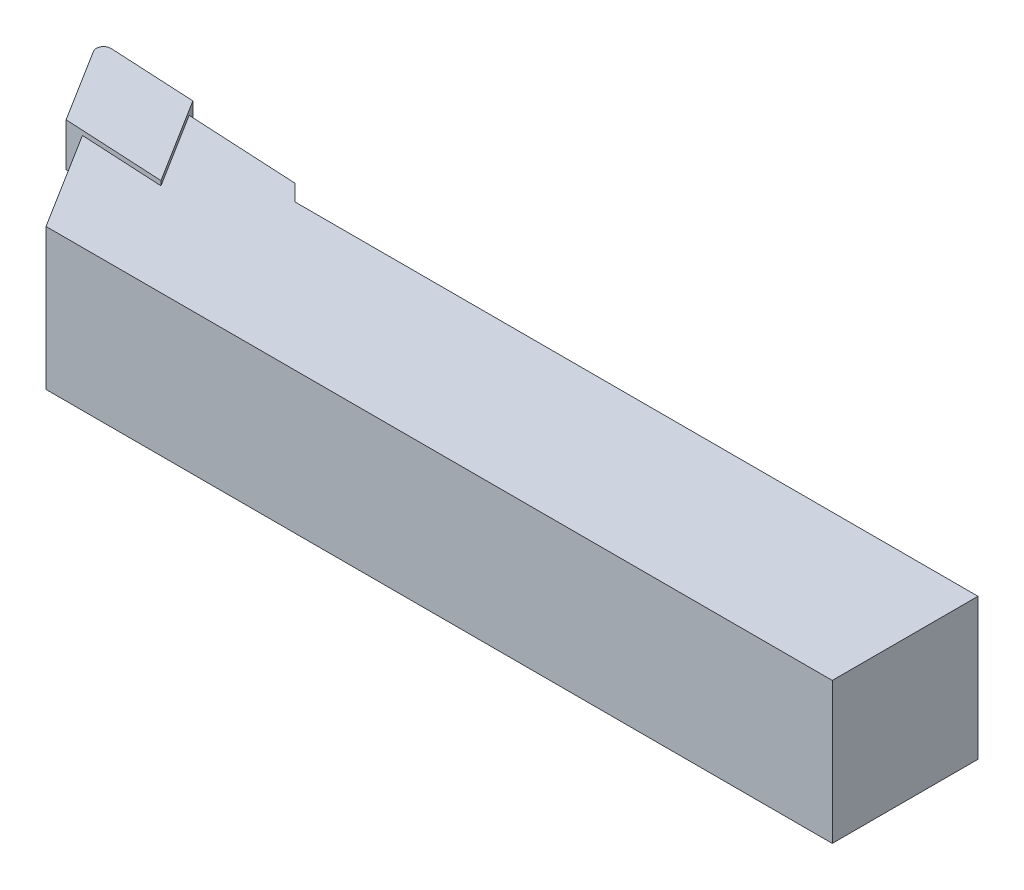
from build123d import *

# Parameters (mm, degrees)
BASE_EXTRUSION_DEPTH = 4.76
BOSS_EXTRU_1_DEPTH   = 15.5


with BuildPart() as part:
    # EsqPlaquette → Base-Extrusion (new body)
    with BuildSketch(Plane(origin=(0, 0, 0), x_dir=(1, 0, 0), z_dir=(0, 1, 0))):
        with BuildLine():
            Line((0.121561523, -1.223935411), (5.136301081, -9.249196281))
            Line((5.136301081, -9.249196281), (16.121225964, -9.824891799))
            Line((16.121225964, -9.824891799), (10.292114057, -0.496362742))
            Line((10.292114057, -0.496362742), (0.841868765, -0.001096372))
            ThreePointArc((0.841868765, -0.001096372), (0.110696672, -0.39396931), (0.121561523, -1.223935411))
        make_face()
    extrude(amount=-BASE_EXTRUSION_DEPTH)

    # Esquisse2 → Boss.-Extru.1 (add)
    with BuildSketch(Plane(origin=(0, -0.5, 0), x_dir=(-1, 0, 0), z_dir=(0, 1, 0))):
        Polygon((-100, 4), (-100, 20), (-13.676565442, 20), (-1.866013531, 1.099165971), (-23.218185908, 2.218185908), (-25, 4), align=None)
    extrude(amount=-BOSS_EXTRU_1_DEPTH)


solid = part.part
